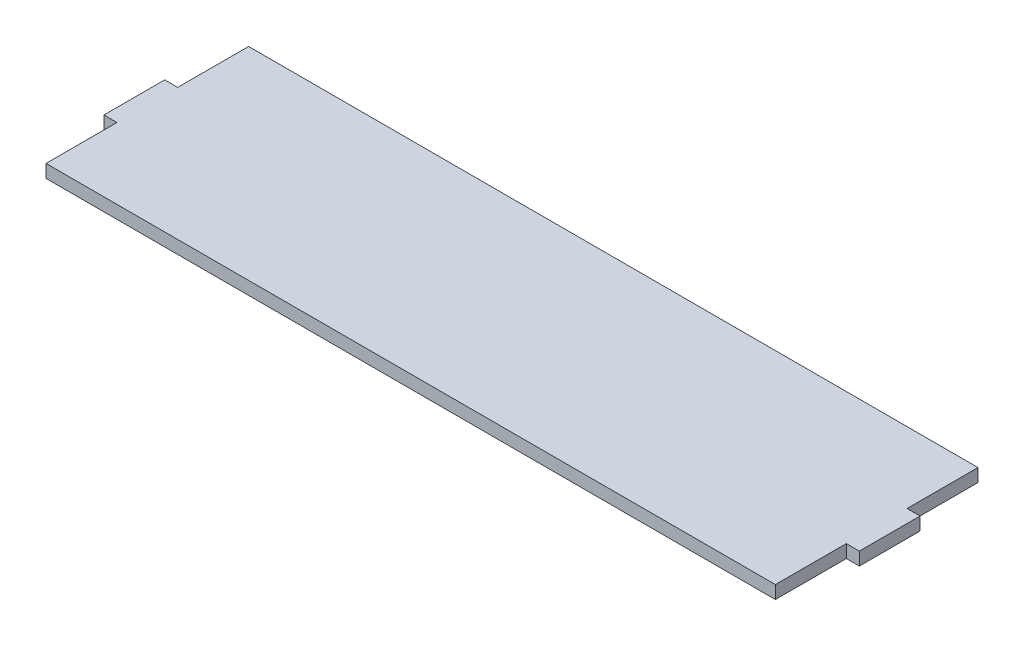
from build123d import *

# Parameters (mm, degrees)
BOSS_EXTRUDE1_DEPTH = 16.30000042


with BuildPart() as part:
    # Sketch1 → Boss-Extrude1 (new body)
    with BuildSketch(Plane(origin=(0, 0, 0), x_dir=(1, 0, 0), z_dir=(0, 1, 0))):
        Polygon((-59.371990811, 234.723418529), (855.028009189, 234.723418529), (855.028009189, 145.823418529), (871.328009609, 145.823418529), (871.328009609, 69.623418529), (855.028009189, 69.623418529), (855.028009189, -19.276581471), (-59.371990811, -19.276581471), (-59.371990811, 69.623418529), (-75.671991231, 69.623418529), (-75.671991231, 145.823418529), (-59.371990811, 145.823418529), align=None)
    extrude(amount=BOSS_EXTRUDE1_DEPTH)


solid = part.part
